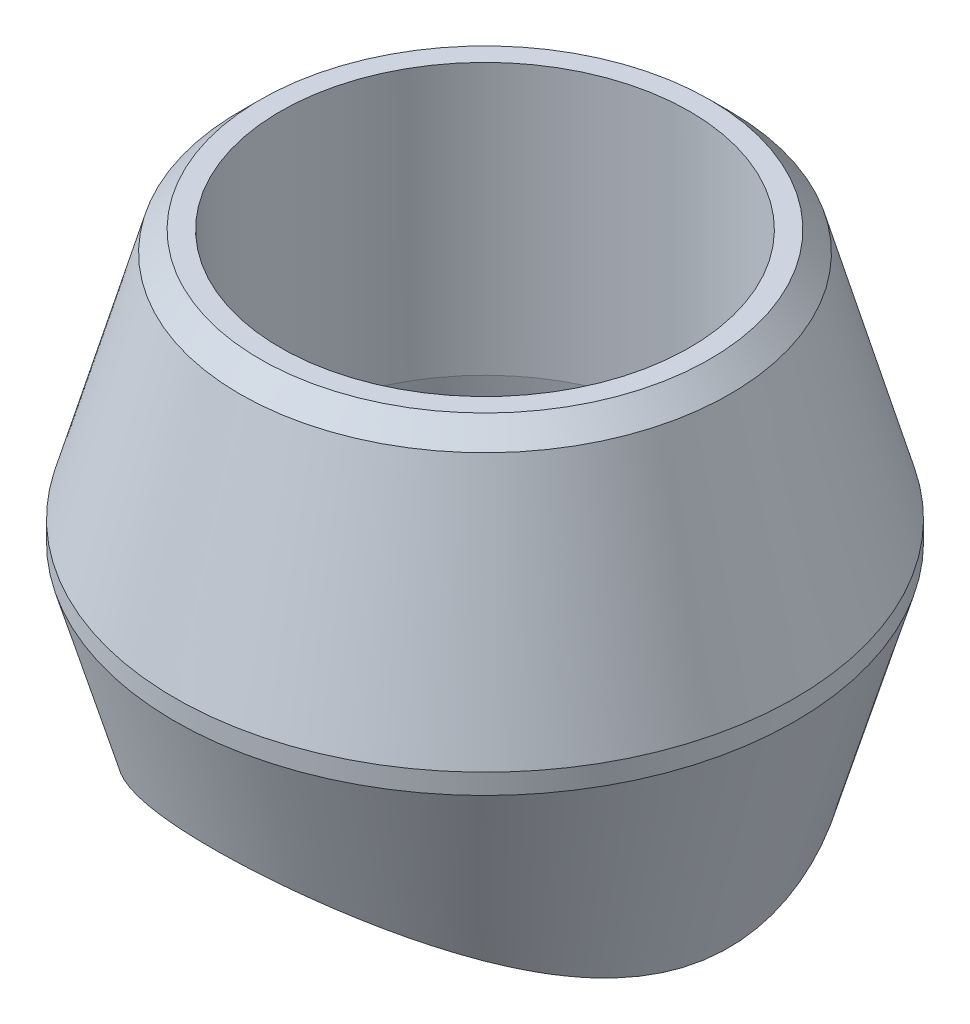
ISO-10303-21;
HEADER;
FILE_DESCRIPTION(('STEP AP214'),'2;1');
FILE_NAME('part.step','',(''),(''),'','','');
FILE_SCHEMA(('AUTOMOTIVE_DESIGN { 1 0 10303 214 1 1 1 1 }'));
ENDSEC;
DATA;
#1=APPLICATION_CONTEXT('core data for automotive mechanical design processes');
#2=APPLICATION_PROTOCOL_DEFINITION('international standard','automotive_design',2000,#1);
#3=PRODUCT_CONTEXT('',#1,'mechanical');
#4=PRODUCT('Part','Part','',(#3));
#5=PRODUCT_RELATED_PRODUCT_CATEGORY('part','',(#4));
#6=PRODUCT_DEFINITION_FORMATION('','',#4);
#7=PRODUCT_DEFINITION_CONTEXT('part definition',#1,'design');
#8=PRODUCT_DEFINITION('design','',#6,#7);
#9=PRODUCT_DEFINITION_SHAPE('','',#8);
#10=(LENGTH_UNIT() NAMED_UNIT(*) SI_UNIT(.MILLI.,.METRE.));
#11=(NAMED_UNIT(*) PLANE_ANGLE_UNIT() SI_UNIT($,.RADIAN.));
#12=(NAMED_UNIT(*) SI_UNIT($,.STERADIAN.) SOLID_ANGLE_UNIT());
#13=UNCERTAINTY_MEASURE_WITH_UNIT(LENGTH_MEASURE(1.E-05),#10,'distance_accuracy_value','');
#14=(GEOMETRIC_REPRESENTATION_CONTEXT(3) GLOBAL_UNCERTAINTY_ASSIGNED_CONTEXT((#13)) GLOBAL_UNIT_ASSIGNED_CONTEXT((#10,
#11,#12)) REPRESENTATION_CONTEXT('',''));
#15=CARTESIAN_POINT('',(0.,0.,0.));
#16=DIRECTION('',(0.,0.,1.));
#17=DIRECTION('',(1.,0.,0.));
#18=AXIS2_PLACEMENT_3D('',#15,#16,#17);
#19=CARTESIAN_POINT('',(0.,36.4813097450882,0.));
#20=DIRECTION('',(0.,1.,0.));
#21=DIRECTION('',(0.,0.,1.));
#22=AXIS2_PLACEMENT_3D('',#19,#20,#21);
#23=CONICAL_SURFACE('',#22,25.4,0.281926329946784);
#24=CARTESIAN_POINT('',(-14.6804491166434,21.8518971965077,-15.2428727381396));
#25=CARTESIAN_POINT('',(-13.8315857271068,22.3677564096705,-16.2671575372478));
#26=CARTESIAN_POINT('',(-12.8911716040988,22.8785568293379,-17.208947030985));
#27=CARTESIAN_POINT('',(-10.7947108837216,23.8452839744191,-18.9190722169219));
#28=CARTESIAN_POINT('',(-9.63355555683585,24.2998824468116,-19.6839459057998));
#29=CARTESIAN_POINT('',(-7.17115096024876,25.0652491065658,-20.9428980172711));
#30=CARTESIAN_POINT('',(-5.82080202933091,25.3876088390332,-21.4563056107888));
#31=CARTESIAN_POINT('',(-3.07181575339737,25.8244609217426,-22.1462679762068));
#32=CARTESIAN_POINT('',(-1.61462849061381,25.9473238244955,-22.3367139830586));
#33=CARTESIAN_POINT('',(2.71916875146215,25.9745039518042,-22.3792786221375));
#34=CARTESIAN_POINT('',(5.57503933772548,25.5294190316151,-21.7002590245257));
#35=CARTESIAN_POINT('',(9.33155335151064,24.4064651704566,-19.8617893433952));
#36=CARTESIAN_POINT('',(10.5071248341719,23.9621648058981,-19.1183814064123));
#37=CARTESIAN_POINT('',(12.6171117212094,23.0168227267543,-17.4591392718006));
#38=CARTESIAN_POINT('',(13.5768703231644,22.509913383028,-16.5349051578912));
#39=CARTESIAN_POINT('',(15.3242127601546,21.4704502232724,-14.4966572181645));
#40=CARTESIAN_POINT('',(16.1013412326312,20.9431577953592,-13.3912302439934));
#41=CARTESIAN_POINT('',(17.4393283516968,19.9546113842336,-11.0695112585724));
#42=CARTESIAN_POINT('',(18.0100190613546,19.4871494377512,-9.84358152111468));
#43=CARTESIAN_POINT('',(18.956651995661,18.6651330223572,-7.22626596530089));
#44=CARTESIAN_POINT('',(19.320311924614,18.3221720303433,-5.85994487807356));
#45=CARTESIAN_POINT('',(19.8167669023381,17.842561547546,-3.06500714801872));
#46=CARTESIAN_POINT('',(19.9510201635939,17.7058088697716,-1.59590452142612));
#47=CARTESIAN_POINT('',(19.966876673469,17.689835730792,1.29114854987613));
#48=CARTESIAN_POINT('',(19.8554181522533,17.8038483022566,2.72988471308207));
#49=CARTESIAN_POINT('',(19.3873450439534,18.2585551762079,5.5762934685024));
#50=CARTESIAN_POINT('',(19.0412114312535,18.5862504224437,6.93217327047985));
#51=CARTESIAN_POINT('',(17.6967865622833,19.7685882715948,10.8100988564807));
#52=CARTESIAN_POINT('',(16.3567439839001,20.8341954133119,13.2235702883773));
#53=CARTESIAN_POINT('',(12.980715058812,22.8838423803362,17.2904553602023));
#54=CARTESIAN_POINT('',(10.8436545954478,23.9239898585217,19.0670900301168));
#55=CARTESIAN_POINT('',(5.90228519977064,25.4593619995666,21.58971968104));
#56=CARTESIAN_POINT('',(3.05722371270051,25.9400866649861,22.3255554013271));
#57=CARTESIAN_POINT('',(-2.71575059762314,25.9726725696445,22.3762357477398));
#58=CARTESIAN_POINT('',(-5.59176000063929,25.5225121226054,21.6886134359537));
#59=CARTESIAN_POINT('',(-9.33050493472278,24.4077419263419,19.8640479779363));
#60=CARTESIAN_POINT('',(-10.4788699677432,23.9738430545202,19.1383861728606));
#61=CARTESIAN_POINT('',(-12.6219264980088,23.0156321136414,17.4575350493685));
#62=CARTESIAN_POINT('',(-13.5898587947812,22.502474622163,16.5205001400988));
#63=CARTESIAN_POINT('',(-16.1796292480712,20.9610009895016,13.4973309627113));
#64=CARTESIAN_POINT('',(-17.5462237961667,19.8911835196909,11.1212509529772));
#65=CARTESIAN_POINT('',(-18.9462608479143,18.6735077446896,7.25731995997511));
#66=CARTESIAN_POINT('',(-19.3157831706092,18.3265393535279,5.88462355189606));
#67=CARTESIAN_POINT('',(-19.8150058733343,17.8442672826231,3.07574916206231));
#68=CARTESIAN_POINT('',(-19.9480281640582,17.7087617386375,1.65183929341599));
#69=CARTESIAN_POINT('',(-19.9798143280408,17.676922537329,-2.70397483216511));
#70=CARTESIAN_POINT('',(-19.5040418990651,18.1788532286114,-5.5838484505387));
#71=CARTESIAN_POINT('',(-18.1499778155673,19.3702385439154,-9.50943315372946));
#72=CARTESIAN_POINT('',(-17.5985028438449,19.8279102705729,-10.7448419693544));
#73=CARTESIAN_POINT('',(-16.2934501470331,20.8082329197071,-13.0953381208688));
#74=CARTESIAN_POINT('',(-15.52931250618,21.3360379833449,-14.2185879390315));
#75=CARTESIAN_POINT('',(-14.6804491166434,21.8518971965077,-15.2428727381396));
#76=B_SPLINE_CURVE_WITH_KNOTS('',3,(#24,#25,#26,#27,#28,#29,#30,#31,#32,#33,#34,#35,#36,#37,#38,
#39,#40,#41,#42,#43,#44,#45,#46,#47,#48,#49,#50,#51,#52,#53,#54,#55,#56,#57,#58,#59,#60,#61,#62,
#63,#64,#65,#66,#67,#68,#69,#70,#71,#72,#73,#74,#75),.UNSPECIFIED.,.T.,.F.,(4,2,2,2,2,2,2,2,2,2,
2,2,2,2,2,2,2,2,2,2,2,2,2,2,2,4),(-0.126803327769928,-0.122676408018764,-0.118549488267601,
-0.114422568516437,-0.110295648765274,-0.102041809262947,-0.0979148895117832,
-0.0937879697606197,-0.0896610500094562,-0.0855341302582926,-0.0814072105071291,
-0.0772802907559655,-0.073153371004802,-0.0690264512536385,-0.0607726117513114,
-0.0525187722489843,-0.0442649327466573,-0.0360110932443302,-0.0318841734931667,
-0.0277572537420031,-0.0195034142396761,-0.0153764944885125,-0.011249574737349,
-0.00299573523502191,0.00113118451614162,0.00525810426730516),.UNSPECIFIED.);
#77=CARTESIAN_POINT('',(-14.6804491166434,21.8518971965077,-15.2428727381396));
#78=VERTEX_POINT('',#77);
#79=EDGE_CURVE('E139',#78,#78,#76,.F.);
#80=ORIENTED_EDGE('',*,*,#79,.T.);
#81=EDGE_LOOP('',(#80));
#82=FACE_BOUND('',#81,.T.);
#83=CARTESIAN_POINT('',(0.,36.4813097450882,0.));
#84=DIRECTION('',(0.,-1.,0.));
#85=DIRECTION('',(0.,0.,-1.));
#86=AXIS2_PLACEMENT_3D('',#83,#84,#85);
#87=CIRCLE('',#86,25.4);
#88=CARTESIAN_POINT('',(0.,36.4813097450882,-25.4));
#89=VERTEX_POINT('',#88);
#90=EDGE_CURVE('E275',#89,#89,#87,.T.);
#91=ORIENTED_EDGE('',*,*,#90,.T.);
#92=EDGE_LOOP('',(#91));
#93=FACE_BOUND('',#92,.T.);
#94=ADVANCED_FACE('F166',(#82,#93),#23,.T.);
#95=CARTESIAN_POINT('',(0.,0.,0.));
#96=DIRECTION('',(0.,-1.,0.));
#97=DIRECTION('',(0.,0.,-1.));
#98=AXIS2_PLACEMENT_3D('',#95,#96,#97);
#99=CYLINDRICAL_SURFACE('',#98,16.764);
#100=CARTESIAN_POINT('',(0.,36.4813097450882,0.));
#101=DIRECTION('',(0.,1.,0.));
#102=DIRECTION('',(0.,0.,1.));
#103=AXIS2_PLACEMENT_3D('',#100,#101,#102);
#104=CIRCLE('',#103,16.764);
#105=CARTESIAN_POINT('',(0.,36.4813097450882,16.764));
#106=VERTEX_POINT('',#105);
#107=EDGE_CURVE('E278',#106,#106,#104,.F.);
#108=ORIENTED_EDGE('',*,*,#107,.T.);
#109=EDGE_LOOP('',(#108));
#110=FACE_BOUND('',#109,.T.);
#111=CARTESIAN_POINT('',(0.,58.674,0.));
#112=DIRECTION('',(0.,-1.,0.));
#113=DIRECTION('',(0.,0.,-1.));
#114=AXIS2_PLACEMENT_3D('',#111,#112,#113);
#115=CIRCLE('',#114,16.764);
#116=CARTESIAN_POINT('',(0.,58.674,-16.764));
#117=VERTEX_POINT('',#116);
#118=EDGE_CURVE('E189',#117,#117,#115,.T.);
#119=ORIENTED_EDGE('',*,*,#118,.F.);
#120=EDGE_LOOP('',(#119));
#121=FACE_BOUND('',#120,.T.);
#122=ADVANCED_FACE('F266',(#110,#121),#99,.F.);
#123=CARTESIAN_POINT('',(-7.05507719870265,58.674,0.));
#124=DIRECTION('',(0.,-1.,0.));
#125=DIRECTION('',(0.,0.,-1.));
#126=AXIS2_PLACEMENT_3D('',#123,#124,#125);
#127=PLANE('',#126);
#128=CARTESIAN_POINT('',(0.,58.674,0.));
#129=DIRECTION('',(0.,-1.,0.));
#130=DIRECTION('',(0.,0.,-1.));
#131=AXIS2_PLACEMENT_3D('',#128,#129,#130);
#132=CIRCLE('',#131,18.415);
#133=CARTESIAN_POINT('',(0.,58.674,-18.415));
#134=VERTEX_POINT('',#133);
#135=EDGE_CURVE('E197',#134,#134,#132,.T.);
#136=ORIENTED_EDGE('',*,*,#135,.F.);
#137=EDGE_LOOP('',(#136));
#138=FACE_BOUND('',#137,.T.);
#139=ORIENTED_EDGE('',*,*,#118,.T.);
#140=EDGE_LOOP('',(#139));
#141=FACE_BOUND('',#140,.T.);
#142=ADVANCED_FACE('F270',(#138,#141),#127,.F.);
#143=CARTESIAN_POINT('',(0.,58.674,0.));
#144=DIRECTION('',(0.,-1.,0.));
#145=DIRECTION('',(0.,0.,-1.));
#146=AXIS2_PLACEMENT_3D('',#143,#144,#145);
#147=CONICAL_SURFACE('',#146,18.415,0.785398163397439);
#148=CARTESIAN_POINT('',(0.,57.023,0.));
#149=DIRECTION('',(0.,-1.,0.));
#150=DIRECTION('',(0.,0.,-1.));
#151=AXIS2_PLACEMENT_3D('',#148,#149,#150);
#152=CIRCLE('',#151,20.066);
#153=CARTESIAN_POINT('',(0.,57.023,-20.066));
#154=VERTEX_POINT('',#153);
#155=EDGE_CURVE('E202',#154,#154,#152,.T.);
#156=ORIENTED_EDGE('',*,*,#155,.F.);
#157=EDGE_LOOP('',(#156));
#158=FACE_BOUND('',#157,.T.);
#159=ORIENTED_EDGE('',*,*,#135,.T.);
#160=EDGE_LOOP('',(#159));
#161=FACE_BOUND('',#160,.T.);
#162=ADVANCED_FACE('F290',(#158,#161),#147,.T.);
#163=CARTESIAN_POINT('',(0.,57.023,0.));
#164=DIRECTION('',(0.,-1.,0.));
#165=DIRECTION('',(0.,0.,-1.));
#166=AXIS2_PLACEMENT_3D('',#163,#164,#165);
#167=CONICAL_SURFACE('',#166,20.066,0.275196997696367);
#168=CARTESIAN_POINT('',(0.,38.1323097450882,0.));
#169=DIRECTION('',(0.,-1.,0.));
#170=DIRECTION('',(0.,0.,-1.));
#171=AXIS2_PLACEMENT_3D('',#168,#169,#170);
#172=CIRCLE('',#171,25.4);
#173=CARTESIAN_POINT('',(0.,38.1323097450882,-25.4));
#174=VERTEX_POINT('',#173);
#175=EDGE_CURVE('E277',#174,#174,#172,.T.);
#176=ORIENTED_EDGE('',*,*,#175,.F.);
#177=EDGE_LOOP('',(#176));
#178=FACE_BOUND('',#177,.T.);
#179=ORIENTED_EDGE('',*,*,#155,.T.);
#180=EDGE_LOOP('',(#179));
#181=FACE_BOUND('',#180,.T.);
#182=ADVANCED_FACE('F288',(#178,#181),#167,.T.);
#183=CARTESIAN_POINT('',(0.,0.,0.));
#184=DIRECTION('',(0.,-1.,0.));
#185=DIRECTION('',(0.,0.,-1.));
#186=AXIS2_PLACEMENT_3D('',#183,#184,#185);
#187=CYLINDRICAL_SURFACE('',#186,25.4);
#188=ORIENTED_EDGE('',*,*,#90,.F.);
#189=EDGE_LOOP('',(#188));
#190=FACE_BOUND('',#189,.T.);
#191=ORIENTED_EDGE('',*,*,#175,.T.);
#192=EDGE_LOOP('',(#191));
#193=FACE_BOUND('',#192,.T.);
#194=ADVANCED_FACE('F225',(#190,#193),#187,.T.);
#195=CARTESIAN_POINT('',(0.,0.,25.4));
#196=DIRECTION('',(0.,0.,-1.));
#197=DIRECTION('',(-1.,0.,0.));
#198=AXIS2_PLACEMENT_3D('',#195,#196,#197);
#199=CYLINDRICAL_SURFACE('',#198,25.4);
#200=CARTESIAN_POINT('',(-13.6486273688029,21.4213671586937,-14.6216164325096));
#201=CARTESIAN_POINT('',(-13.8913343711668,21.2667437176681,-14.3163394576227));
#202=CARTESIAN_POINT('',(-14.125097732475,21.111976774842,-14.00406722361));
#203=CARTESIAN_POINT('',(-14.5762222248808,20.8030366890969,-13.3644192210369));
#204=CARTESIAN_POINT('',(-14.7934789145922,20.6488723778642,-13.0369654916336));
#205=CARTESIAN_POINT('',(-15.2101388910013,20.3439415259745,-12.3695863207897));
#206=CARTESIAN_POINT('',(-15.409549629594,20.1931735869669,-12.0296661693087));
#207=CARTESIAN_POINT('',(-15.7894911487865,19.8975138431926,-11.3391979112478));
#208=CARTESIAN_POINT('',(-15.970101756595,19.7525989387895,-10.9887036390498));
#209=CARTESIAN_POINT('',(-16.3136304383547,19.4699230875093,-10.2765865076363));
#210=CARTESIAN_POINT('',(-16.4765573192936,19.3321585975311,-9.91496930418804));
#211=CARTESIAN_POINT('',(-16.7847079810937,19.065393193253,-9.17970955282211));
#212=CARTESIAN_POINT('',(-16.9298795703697,18.9364185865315,-8.80603544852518));
#213=CARTESIAN_POINT('',(-17.1341688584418,18.7508862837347,-8.23714031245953));
#214=CARTESIAN_POINT('',(-17.200150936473,18.6902390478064,-8.04568036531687));
#215=CARTESIAN_POINT('',(-17.327595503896,18.5720033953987,-7.65972146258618));
#216=CARTESIAN_POINT('',(-17.3890458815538,18.5144232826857,-7.46521593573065));
#217=CARTESIAN_POINT('',(-17.5072170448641,18.4028725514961,-7.0734791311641));
#218=CARTESIAN_POINT('',(-17.5639321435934,18.3489062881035,-6.8762448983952));
#219=CARTESIAN_POINT('',(-17.6725966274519,18.2447141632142,-6.47927931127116));
#220=CARTESIAN_POINT('',(-17.7245415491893,18.1944918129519,-6.27954581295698));
#221=CARTESIAN_POINT('',(-17.82360474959,18.0980116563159,-5.87777740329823));
#222=CARTESIAN_POINT('',(-17.8707196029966,18.051756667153,-5.67574097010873));
#223=CARTESIAN_POINT('',(-17.9600685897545,17.9634102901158,-5.26957142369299));
#224=CARTESIAN_POINT('',(-18.0023001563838,17.9213210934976,-5.0654372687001));
#225=CARTESIAN_POINT('',(-18.0818268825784,17.841511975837,-4.65527477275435));
#226=CARTESIAN_POINT('',(-18.1191201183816,17.8037937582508,-4.44924572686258));
#227=CARTESIAN_POINT('',(-18.188715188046,17.732930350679,-4.03549671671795));
#228=CARTESIAN_POINT('',(-18.2210154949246,17.6997865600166,-3.82777625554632));
#229=CARTESIAN_POINT('',(-18.2805698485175,17.6382759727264,-3.41084763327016));
#230=CARTESIAN_POINT('',(-18.3078224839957,17.609910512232,-3.20163907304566));
#231=CARTESIAN_POINT('',(-18.3572268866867,17.5581604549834,-2.78193761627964));
#232=CARTESIAN_POINT('',(-18.3793770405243,17.5347774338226,-2.57144433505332));
#233=CARTESIAN_POINT('',(-18.418522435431,17.4931947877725,-2.14937687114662));
#234=CARTESIAN_POINT('',(-18.4355155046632,17.4749973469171,-1.93780227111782));
#235=CARTESIAN_POINT('',(-18.4642921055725,17.4439919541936,-1.51377560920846));
#236=CARTESIAN_POINT('',(-18.4760725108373,17.4311872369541,-1.30132309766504));
#237=CARTESIAN_POINT('',(-18.4943730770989,17.4111581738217,-0.875744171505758));
#238=CARTESIAN_POINT('',(-18.5008887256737,17.4039386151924,-0.6626173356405));
#239=CARTESIAN_POINT('',(-18.5085963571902,17.3953253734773,-0.235892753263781));
#240=CARTESIAN_POINT('',(-18.5097819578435,17.3939386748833,-0.0222947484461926));
#241=CARTESIAN_POINT('',(-18.5068207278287,17.3970246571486,0.404444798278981));
#242=CARTESIAN_POINT('',(-18.5026832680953,17.4014870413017,0.617586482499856));
#243=CARTESIAN_POINT('',(-18.4891251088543,17.4159998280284,1.04267086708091));
#244=CARTESIAN_POINT('',(-18.4797252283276,17.4260282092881,1.25461498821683));
#245=CARTESIAN_POINT('',(-18.4556768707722,17.4515710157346,1.67736771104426));
#246=CARTESIAN_POINT('',(-18.4410408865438,17.4670723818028,1.8881778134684));
#247=CARTESIAN_POINT('',(-18.4065671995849,17.5034046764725,2.3087273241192));
#248=CARTESIAN_POINT('',(-18.3867339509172,17.5242310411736,2.51846749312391));
#249=CARTESIAN_POINT('',(-18.3419111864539,17.5710719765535,2.93694326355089));
#250=CARTESIAN_POINT('',(-18.3169185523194,17.5970896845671,3.14567817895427));
#251=CARTESIAN_POINT('',(-18.2618137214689,17.6541698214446,3.56220786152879));
#252=CARTESIAN_POINT('',(-18.231691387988,17.6852422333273,3.76999991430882));
#253=CARTESIAN_POINT('',(-18.1664086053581,17.7522749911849,4.18464627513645));
#254=CARTESIAN_POINT('',(-18.1312334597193,17.7882495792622,4.39149596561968));
#255=CARTESIAN_POINT('',(-18.055723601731,17.864903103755,4.80366746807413));
#256=CARTESIAN_POINT('',(-18.0153820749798,17.9055882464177,5.00898687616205));
#257=CARTESIAN_POINT('',(-17.9297164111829,17.9913093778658,5.41768251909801));
#258=CARTESIAN_POINT('',(-17.884391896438,18.0363456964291,5.62105860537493));
#259=CARTESIAN_POINT('',(-17.788895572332,18.1304469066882,6.02549713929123));
#260=CARTESIAN_POINT('',(-17.7387287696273,18.1795076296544,6.22656174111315));
#261=CARTESIAN_POINT('',(-17.6336890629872,18.2813340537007,6.62600837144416));
#262=CARTESIAN_POINT('',(-17.5788267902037,18.3340913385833,6.82439534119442));
#263=CARTESIAN_POINT('',(-17.4645468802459,18.4429675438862,7.21811667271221));
#264=CARTESIAN_POINT('',(-17.4051456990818,18.4990741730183,7.41345923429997));
#265=CARTESIAN_POINT('',(-17.2205552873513,18.6717694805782,7.99344730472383));
#266=CARTESIAN_POINT('',(-17.0883587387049,18.7933392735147,8.3744143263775));
#267=CARTESIAN_POINT('',(-16.8054370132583,19.0469581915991,9.12621657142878));
#268=CARTESIAN_POINT('',(-16.6546948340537,19.1790168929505,9.49704211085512));
#269=CARTESIAN_POINT('',(-16.3349586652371,19.4517814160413,10.2281981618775));
#270=CARTESIAN_POINT('',(-16.1659381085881,19.5924996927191,10.5885124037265));
#271=CARTESIAN_POINT('',(-15.8100650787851,19.8804635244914,11.2974849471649));
#272=CARTESIAN_POINT('',(-15.6232141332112,20.0277085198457,11.6461442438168));
#273=CARTESIAN_POINT('',(-15.2321062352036,20.326624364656,12.3306532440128));
#274=CARTESIAN_POINT('',(-15.0278810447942,20.4782868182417,12.6665247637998));
#275=CARTESIAN_POINT('',(-14.6024581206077,20.7839278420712,13.3243044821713));
#276=CARTESIAN_POINT('',(-14.38132333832,20.9378962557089,13.6462580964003));
#277=CARTESIAN_POINT('',(-13.9224645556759,21.2460218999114,14.2750191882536));
#278=CARTESIAN_POINT('',(-13.6848347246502,21.4001738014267,14.5818979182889));
#279=CARTESIAN_POINT('',(-13.19215335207,21.7074532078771,15.1811269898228));
#280=CARTESIAN_POINT('',(-12.9371241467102,21.8605817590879,15.4734951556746));
#281=CARTESIAN_POINT('',(-12.4085767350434,22.1648686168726,16.044166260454));
#282=CARTESIAN_POINT('',(-12.1350022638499,22.3160191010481,16.3224214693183));
#283=CARTESIAN_POINT('',(-11.7110592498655,22.5396882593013,16.7278278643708));
#284=CARTESIAN_POINT('',(-11.5673330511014,22.6138067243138,16.8610926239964));
#285=CARTESIAN_POINT('',(-11.2752588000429,22.7608396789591,17.1235321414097));
#286=CARTESIAN_POINT('',(-11.1269058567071,22.8337527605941,17.2527022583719));
#287=CARTESIAN_POINT('',(-10.8257197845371,22.9780716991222,17.506647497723));
#288=CARTESIAN_POINT('',(-10.6728858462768,23.0494772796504,17.6314218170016));
#289=CARTESIAN_POINT('',(-10.3635536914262,23.1902143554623,17.8758564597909));
#290=CARTESIAN_POINT('',(-10.2070758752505,23.2595539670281,17.9955379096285));
#291=CARTESIAN_POINT('',(-9.89044128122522,23.3959691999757,18.2296290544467));
#292=CARTESIAN_POINT('',(-9.73030350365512,23.4630533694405,18.3440594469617));
#293=CARTESIAN_POINT('',(-9.40621533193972,23.5948375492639,18.5676337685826));
#294=CARTESIAN_POINT('',(-9.24227794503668,23.6595441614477,18.6767926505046));
#295=CARTESIAN_POINT('',(-8.91045780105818,23.7864590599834,18.8898115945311));
#296=CARTESIAN_POINT('',(-8.7425817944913,23.8486711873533,18.9936798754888));
#297=CARTESIAN_POINT('',(-8.40273302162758,23.9704629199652,19.1960816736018));
#298=CARTESIAN_POINT('',(-8.23076065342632,24.0300427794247,19.2946157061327));
#299=CARTESIAN_POINT('',(-7.88264279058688,24.1465147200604,19.4864108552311));
#300=CARTESIAN_POINT('',(-7.70649147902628,24.2034026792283,19.5796639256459));
#301=CARTESIAN_POINT('',(-7.34993556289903,24.314058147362,19.7604556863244));
#302=CARTESIAN_POINT('',(-7.16952471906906,24.3678206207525,19.8479851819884));
#303=CARTESIAN_POINT('',(-6.80470149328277,24.4717845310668,20.0167839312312));
#304=CARTESIAN_POINT('',(-6.62028764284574,24.5219846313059,20.098050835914));
#305=CARTESIAN_POINT('',(-6.24783391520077,24.6187322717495,20.2542361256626));
#306=CARTESIAN_POINT('',(-6.05979379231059,24.6652795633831,20.3291540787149));
#307=CARTESIAN_POINT('',(-5.68039048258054,24.7545507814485,20.4724542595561));
#308=CARTESIAN_POINT('',(-5.48902798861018,24.7972754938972,20.540837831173));
#309=CARTESIAN_POINT('',(-5.10330267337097,24.8787520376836,20.6709086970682));
#310=CARTESIAN_POINT('',(-4.90894120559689,24.9175056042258,20.7325989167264));
#311=CARTESIAN_POINT('',(-4.51753571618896,24.9908847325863,20.8491156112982));
#312=CARTESIAN_POINT('',(-4.32049343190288,25.0255128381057,20.9039463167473));
#313=CARTESIAN_POINT('',(-3.92404574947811,25.0904875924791,21.0065787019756));
#314=CARTESIAN_POINT('',(-3.72464220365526,25.1208373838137,21.0543855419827));
#315=CARTESIAN_POINT('',(-3.3237913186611,25.1771018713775,21.142804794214));
#316=CARTESIAN_POINT('',(-3.12234570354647,25.203020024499,21.1834228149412));
#317=CARTESIAN_POINT('',(-2.71773032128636,25.2502679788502,21.2572996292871));
#318=CARTESIAN_POINT('',(-2.51456194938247,25.2716011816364,21.2905638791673));
#319=CARTESIAN_POINT('',(-2.10682087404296,25.3095264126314,21.3495690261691));
#320=CARTESIAN_POINT('',(-1.9022491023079,25.3261213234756,21.3753144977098));
#321=CARTESIAN_POINT('',(-1.49202107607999,25.3544173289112,21.4191183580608));
#322=CARTESIAN_POINT('',(-1.28636524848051,25.366120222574,21.4371795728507));
#323=CARTESIAN_POINT('',(-0.874289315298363,25.3844812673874,21.4654534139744));
#324=CARTESIAN_POINT('',(-0.66786921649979,25.3911394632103,21.4756661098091));
#325=CARTESIAN_POINT('',(-0.254583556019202,25.3992566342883,21.4880774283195));
#326=CARTESIAN_POINT('',(-0.0477178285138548,25.4007131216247,21.4902722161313));
#327=CARTESIAN_POINT('',(0.365846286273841,25.3982907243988,21.4865047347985));
#328=CARTESIAN_POINT('',(0.572544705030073,25.3944134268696,21.4805448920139));
#329=CARTESIAN_POINT('',(0.985185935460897,25.3814835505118,21.4606343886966));
#330=CARTESIAN_POINT('',(1.19112929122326,25.3724360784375,21.4466916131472));
#331=CARTESIAN_POINT('',(1.60197578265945,25.3493230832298,21.4109826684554));
#332=CARTESIAN_POINT('',(1.80687926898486,25.3352593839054,21.3892193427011));
#333=CARTESIAN_POINT('',(2.21536080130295,25.3022744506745,21.3380403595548));
#334=CARTESIAN_POINT('',(2.41893866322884,25.2833525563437,21.3086236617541));
#335=CARTESIAN_POINT('',(2.82448430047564,25.2408098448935,21.2423065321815));
#336=CARTESIAN_POINT('',(3.02645118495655,25.2171865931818,21.205402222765));
#337=CARTESIAN_POINT('',(3.42849026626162,25.1653993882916,21.1242777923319));
#338=CARTESIAN_POINT('',(3.62856082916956,25.1372318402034,21.0800518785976));
#339=CARTESIAN_POINT('',(4.02652266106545,25.0765135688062,20.9844511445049));
#340=CARTESIAN_POINT('',(4.22441162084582,25.0439586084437,20.9330694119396));
#341=CARTESIAN_POINT('',(4.61772558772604,24.974622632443,20.823323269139));
#342=CARTESIAN_POINT('',(4.81314775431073,24.9378371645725,20.764951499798));
#343=CARTESIAN_POINT('',(5.20124307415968,24.8601966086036,20.6413905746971));
#344=CARTESIAN_POINT('',(5.3939130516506,24.819337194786,20.5761941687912));
#345=CARTESIAN_POINT('',(5.77621955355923,24.733705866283,20.4391497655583));
#346=CARTESIAN_POINT('',(5.96585279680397,24.6889300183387,20.367295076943));
#347=CARTESIAN_POINT('',(6.34179797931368,24.5956189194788,20.217095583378));
#348=CARTESIAN_POINT('',(6.52810677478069,24.5470803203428,20.1387449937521));
#349=CARTESIAN_POINT('',(6.89712675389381,24.4464107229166,19.9757293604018));
#350=CARTESIAN_POINT('',(7.07983519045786,24.3942771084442,19.891059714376));
#351=CARTESIAN_POINT('',(7.44133376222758,24.2865317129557,19.7155271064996));
#352=CARTESIAN_POINT('',(7.62012176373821,24.2309180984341,19.6246608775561));
#353=CARTESIAN_POINT('',(7.97375269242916,24.1164816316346,19.4369901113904));
#354=CARTESIAN_POINT('',(8.14859137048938,24.0576555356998,19.340179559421));
#355=CARTESIAN_POINT('',(8.49447376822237,23.9371705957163,19.1409588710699));
#356=CARTESIAN_POINT('',(8.66551061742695,23.8755071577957,19.0385395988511));
#357=CARTESIAN_POINT('',(9.00365754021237,23.7495598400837,18.8282896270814));
#358=CARTESIAN_POINT('',(9.17076082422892,23.6852718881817,18.720450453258));
#359=CARTESIAN_POINT('',(9.50095417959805,23.5543397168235,18.4996016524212));
#360=CARTESIAN_POINT('',(9.66403809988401,23.4876922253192,18.3865847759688));
#361=CARTESIAN_POINT('',(9.98609295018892,23.3522912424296,18.1556071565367));
#362=CARTESIAN_POINT('',(10.1450587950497,23.2835353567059,18.0376407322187));
#363=CARTESIAN_POINT('',(10.4587826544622,23.1441705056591,17.7969925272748));
#364=CARTESIAN_POINT('',(10.6135370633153,23.0735600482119,17.6743069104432));
#365=CARTESIAN_POINT('',(10.9187340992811,22.9307418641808,17.4244535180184));
#366=CARTESIAN_POINT('',(11.0691749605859,22.8585335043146,17.2972839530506));
#367=CARTESIAN_POINT('',(11.5137825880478,22.6399412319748,16.9094861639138));
#368=CARTESIAN_POINT('',(11.8013990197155,22.491516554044,16.642442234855));
#369=CARTESIAN_POINT('',(12.3581917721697,22.1913316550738,16.0931804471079));
#370=CARTESIAN_POINT('',(12.6274130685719,22.0395808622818,15.8110028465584));
#371=CARTESIAN_POINT('',(13.1466286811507,21.7347109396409,15.2332655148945));
#372=CARTESIAN_POINT('',(13.3967167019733,21.5816032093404,14.9377840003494));
#373=CARTESIAN_POINT('',(13.8790874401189,21.2747909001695,14.3324112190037));
#374=CARTESIAN_POINT('',(14.1113530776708,21.1210858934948,14.0225065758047));
#375=CARTESIAN_POINT('',(14.5599453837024,20.8140793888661,13.3871956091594));
#376=CARTESIAN_POINT('',(14.7761408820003,20.6607893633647,13.0616912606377));
#377=CARTESIAN_POINT('',(15.1919354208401,20.3568043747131,12.3966182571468));
#378=CARTESIAN_POINT('',(15.3914512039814,20.2061250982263,12.0569904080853));
#379=CARTESIAN_POINT('',(15.7732369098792,19.9096166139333,11.365096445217));
#380=CARTESIAN_POINT('',(15.9554710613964,19.7637978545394,11.0128061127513));
#381=CARTESIAN_POINT('',(16.3020370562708,19.4792557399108,10.2970167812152));
#382=CARTESIAN_POINT('',(16.4663793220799,19.340528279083,9.93352446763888));
#383=CARTESIAN_POINT('',(16.7765252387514,19.0724478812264,9.19677771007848));
#384=CARTESIAN_POINT('',(16.9223834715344,18.9430678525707,8.82355612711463));
#385=CARTESIAN_POINT('',(17.1950303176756,18.6957345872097,8.06826649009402));
#386=CARTESIAN_POINT('',(17.321891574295,18.5777384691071,7.68623893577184));
#387=CARTESIAN_POINT('',(17.4983507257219,18.41094156,7.10565354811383));
#388=CARTESIAN_POINT('',(17.55491733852,18.3569906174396,6.91065802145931));
#389=CARTESIAN_POINT('',(17.663473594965,18.2525972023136,6.51779793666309));
#390=CARTESIAN_POINT('',(17.7154492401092,18.2021655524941,6.31992661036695));
#391=CARTESIAN_POINT('',(17.8147639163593,18.1050577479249,5.92129060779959));
#392=CARTESIAN_POINT('',(17.862085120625,18.0583961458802,5.72051794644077));
#393=CARTESIAN_POINT('',(17.9520330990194,17.9690596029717,5.31604819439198));
#394=CARTESIAN_POINT('',(17.9946377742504,17.9264035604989,5.11234200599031));
#395=CARTESIAN_POINT('',(18.0750896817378,17.8453198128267,4.70197442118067));
#396=CARTESIAN_POINT('',(18.1129100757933,17.8069160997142,4.49530302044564));
#397=CARTESIAN_POINT('',(18.1837012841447,17.7346002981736,4.07927799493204));
#398=CARTESIAN_POINT('',(18.2166475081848,17.7007110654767,3.86991619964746));
#399=CARTESIAN_POINT('',(18.2772621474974,17.6381487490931,3.45025754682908));
#400=CARTESIAN_POINT('',(18.3049449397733,17.609461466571,3.23996489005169));
#401=CARTESIAN_POINT('',(18.3550031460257,17.5573931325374,2.81881596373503));
#402=CARTESIAN_POINT('',(18.3773959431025,17.5339947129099,2.60796390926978));
#403=CARTESIAN_POINT('',(18.416901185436,17.4925690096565,2.18576492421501));
#404=CARTESIAN_POINT('',(18.4340264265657,17.4745287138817,1.97442046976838));
#405=CARTESIAN_POINT('',(18.4630283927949,17.4438703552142,1.55130705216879));
#406=CARTESIAN_POINT('',(18.474913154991,17.4312439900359,1.33953924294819));
#407=CARTESIAN_POINT('',(18.4934493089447,17.4114839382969,0.915648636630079));
#408=CARTESIAN_POINT('',(18.5001038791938,17.4043469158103,0.703526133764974));
#409=CARTESIAN_POINT('',(18.5082575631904,17.3955705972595,0.278994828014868));
#410=CARTESIAN_POINT('',(18.5097549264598,17.393933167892,0.0665859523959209));
#411=CARTESIAN_POINT('',(18.5074361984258,17.3964040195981,-0.358824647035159));
#412=CARTESIAN_POINT('',(18.503603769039,17.40052996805,-0.571826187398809));
#413=CARTESIAN_POINT('',(18.4905375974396,17.4145182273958,-0.998316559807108));
#414=CARTESIAN_POINT('',(18.4812825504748,17.4244031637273,-1.21180398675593));
#415=CARTESIAN_POINT('',(18.4574899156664,17.4496885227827,-1.63859815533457));
#416=CARTESIAN_POINT('',(18.4429414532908,17.4651002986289,-1.85190361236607));
#417=CARTESIAN_POINT('',(18.4086189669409,17.5012812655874,-2.27766267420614));
#418=CARTESIAN_POINT('',(18.3888443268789,17.522051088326,-2.4901161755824));
#419=CARTESIAN_POINT('',(18.3441393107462,17.5687780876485,-2.91349774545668));
#420=CARTESIAN_POINT('',(18.3192186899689,17.5947254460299,-3.12442792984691));
#421=CARTESIAN_POINT('',(18.2643017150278,17.6516205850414,-3.5440955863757));
#422=CARTESIAN_POINT('',(18.234325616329,17.682548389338,-3.75283841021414));
#423=CARTESIAN_POINT('',(18.1692875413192,17.7493320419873,-4.16766349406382));
#424=CARTESIAN_POINT('',(18.1342511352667,17.7851630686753,-4.37375377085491));
#425=CARTESIAN_POINT('',(18.0592219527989,17.861391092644,-4.78426591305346));
#426=CARTESIAN_POINT('',(18.0192271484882,17.90178995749,-4.98868705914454));
#427=CARTESIAN_POINT('',(17.934274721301,17.9869438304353,-5.39589031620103));
#428=CARTESIAN_POINT('',(17.8893102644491,18.0317048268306,-5.59866974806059));
#429=CARTESIAN_POINT('',(17.7944546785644,18.1253329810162,-6.00240742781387));
#430=CARTESIAN_POINT('',(17.744557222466,18.1742053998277,-6.20336296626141));
#431=CARTESIAN_POINT('',(17.6398660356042,18.2758121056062,-6.60327200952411));
#432=CARTESIAN_POINT('',(17.5850667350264,18.3285507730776,-6.80222294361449));
#433=CARTESIAN_POINT('',(17.4706088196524,18.4376350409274,-7.19793614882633));
#434=CARTESIAN_POINT('',(17.410945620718,18.4939840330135,-7.39469615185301));
#435=CARTESIAN_POINT('',(17.224835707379,18.6679789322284,-7.98098355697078));
#436=CARTESIAN_POINT('',(17.0912011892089,18.7906387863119,-8.36677625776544));
#437=CARTESIAN_POINT('',(16.8064934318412,19.0457200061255,-9.12463418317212));
#438=CARTESIAN_POINT('',(16.6555690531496,19.1780549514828,-9.49678484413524));
#439=CARTESIAN_POINT('',(16.3363132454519,19.4506793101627,-10.2276464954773));
#440=CARTESIAN_POINT('',(16.168089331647,19.5909174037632,-10.5864236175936));
#441=CARTESIAN_POINT('',(15.8143473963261,19.8775643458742,-11.2917241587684));
#442=CARTESIAN_POINT('',(15.6288666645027,20.0239595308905,-11.6382718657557));
#443=CARTESIAN_POINT('',(15.2395251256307,20.3218457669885,-12.3204418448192));
#444=CARTESIAN_POINT('',(15.035602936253,20.4733526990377,-12.6560221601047));
#445=CARTESIAN_POINT('',(14.6094777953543,20.7795583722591,-13.3152084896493));
#446=CARTESIAN_POINT('',(14.387231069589,20.9342640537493,-13.6387829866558));
#447=CARTESIAN_POINT('',(13.9249600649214,21.244584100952,-14.2721546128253));
#448=CARTESIAN_POINT('',(13.6849476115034,21.4001977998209,-14.5819606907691));
#449=CARTESIAN_POINT('',(13.1883975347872,21.7097004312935,-15.1854934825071));
#450=CARTESIAN_POINT('',(12.9319627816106,21.863594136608,-15.4793023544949));
#451=CARTESIAN_POINT('',(12.4031001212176,22.1678173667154,-16.0497273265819));
#452=CARTESIAN_POINT('',(12.1307979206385,22.3181643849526,-16.3264501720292));
#453=CARTESIAN_POINT('',(11.7096491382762,22.5402773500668,-16.7289398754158));
#454=CARTESIAN_POINT('',(11.56740301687,22.6136251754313,-16.8607903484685));
#455=CARTESIAN_POINT('',(11.2787448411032,22.7589752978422,-17.1201964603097));
#456=CARTESIAN_POINT('',(11.1323383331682,22.8309791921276,-17.2477573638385));
#457=CARTESIAN_POINT('',(10.8352331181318,22.9735426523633,-17.4986882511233));
#458=CARTESIAN_POINT('',(10.684533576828,23.0441019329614,-17.6220574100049));
#459=CARTESIAN_POINT('',(10.378017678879,23.1837142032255,-17.8646336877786));
#460=CARTESIAN_POINT('',(10.2221831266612,23.2527599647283,-17.9838220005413));
#461=CARTESIAN_POINT('',(9.9056268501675,23.389121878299,-18.2178483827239));
#462=CARTESIAN_POINT('',(9.74489036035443,23.4564313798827,-18.3326703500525));
#463=CARTESIAN_POINT('',(9.41880819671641,23.5890193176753,-18.5576310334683));
#464=CARTESIAN_POINT('',(9.25345370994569,23.6542932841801,-18.667759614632));
#465=CARTESIAN_POINT('',(8.91843403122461,23.7825195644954,-18.8830192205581));
#466=CARTESIAN_POINT('',(8.74876549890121,23.8454699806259,-18.9881461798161));
#467=CARTESIAN_POINT('',(8.40539492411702,23.9687372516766,-19.1930623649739));
#468=CARTESIAN_POINT('',(8.23169446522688,24.0290551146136,-19.2928536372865));
#469=CARTESIAN_POINT('',(7.88060469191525,24.1468175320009,-19.4868424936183));
#470=CARTESIAN_POINT('',(7.70322124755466,24.2042662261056,-19.5810481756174));
#471=CARTESIAN_POINT('',(7.34474107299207,24.3158203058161,-19.7633621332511));
#472=CARTESIAN_POINT('',(7.16365160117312,24.3699315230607,-19.8514810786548));
#473=CARTESIAN_POINT('',(6.79777372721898,24.4744815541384,-20.0212717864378));
#474=CARTESIAN_POINT('',(6.61299107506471,24.5249255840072,-20.1029527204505));
#475=CARTESIAN_POINT('',(6.24005011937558,24.6220572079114,-20.2597894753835));
#476=CARTESIAN_POINT('',(6.05189726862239,24.6687502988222,-20.3349548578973));
#477=CARTESIAN_POINT('',(5.6724760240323,24.7582235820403,-20.4785984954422));
#478=CARTESIAN_POINT('',(5.48121271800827,24.8010095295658,-20.5470865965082));
#479=CARTESIAN_POINT('',(5.09584775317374,24.8825315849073,-20.6772364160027));
#480=CARTESIAN_POINT('',(4.90175063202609,24.9212734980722,-20.7389079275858));
#481=CARTESIAN_POINT('',(4.51099085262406,24.9945655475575,-20.8552796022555));
#482=CARTESIAN_POINT('',(4.31433204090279,25.0291213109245,-20.9099891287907));
#483=CARTESIAN_POINT('',(3.91872304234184,25.0939007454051,-21.012293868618));
#484=CARTESIAN_POINT('',(3.71977588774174,25.1241295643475,-21.0598975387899));
#485=CARTESIAN_POINT('',(3.31986415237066,25.1801147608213,-21.1478476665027));
#486=CARTESIAN_POINT('',(3.11890171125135,25.2058754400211,-21.1882011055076));
#487=CARTESIAN_POINT('',(2.71523349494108,25.2527843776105,-21.261508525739));
#488=CARTESIAN_POINT('',(2.51252895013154,25.2739356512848,-21.2944673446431));
#489=CARTESIAN_POINT('',(2.10565061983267,25.3114866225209,-21.3528440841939));
#490=CARTESIAN_POINT('',(1.90147722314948,25.3278875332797,-21.3782639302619));
#491=CARTESIAN_POINT('',(1.49193510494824,25.3557976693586,-21.4214214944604));
#492=CARTESIAN_POINT('',(1.28656610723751,25.3673057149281,-21.4391573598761));
#493=CARTESIAN_POINT('',(0.874906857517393,25.3852961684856,-21.466808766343));
#494=CARTESIAN_POINT('',(0.668615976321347,25.3917743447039,-21.4767177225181));
#495=CARTESIAN_POINT('',(0.255385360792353,25.3995510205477,-21.488570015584));
#496=CARTESIAN_POINT('',(0.0484451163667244,25.4008414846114,-21.4905009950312));
#497=CARTESIAN_POINT('',(-0.365830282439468,25.3981669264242,-21.4862829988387));
#498=CARTESIAN_POINT('',(-0.573165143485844,25.3941888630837,-21.4801139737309));
#499=CARTESIAN_POINT('',(-0.987731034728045,25.3811681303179,-21.4598760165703));
#500=CARTESIAN_POINT('',(-1.19496088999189,25.3721146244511,-21.445790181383));
#501=CARTESIAN_POINT('',(-1.60866844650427,25.3490492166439,-21.4098574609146));
#502=CARTESIAN_POINT('',(-1.81514523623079,25.3350325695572,-21.3880031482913));
#503=CARTESIAN_POINT('',(-2.22669675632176,25.302168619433,-21.3366811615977));
#504=CARTESIAN_POINT('',(-2.43177190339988,25.2833228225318,-21.3072158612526));
#505=CARTESIAN_POINT('',(-2.8398674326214,25.2409189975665,-21.2408122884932));
#506=CARTESIAN_POINT('',(-3.04289063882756,25.2173687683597,-21.2038863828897));
#507=CARTESIAN_POINT('',(-3.44623571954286,25.1656892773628,-21.1227202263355));
#508=CARTESIAN_POINT('',(-3.64656389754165,25.1375740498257,-21.0785023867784));
#509=CARTESIAN_POINT('',(-4.04416496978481,25.0767987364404,-20.9827669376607));
#510=CARTESIAN_POINT('',(-4.24144484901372,25.0441515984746,-20.9312701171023));
#511=CARTESIAN_POINT('',(-4.63425607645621,24.9742996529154,-20.8208418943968));
#512=CARTESIAN_POINT('',(-4.82977253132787,24.9370715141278,-20.7618723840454));
#513=CARTESIAN_POINT('',(-5.21875390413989,24.8583423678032,-20.6368331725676));
#514=CARTESIAN_POINT('',(-5.41220383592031,24.8168210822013,-20.5707297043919));
#515=CARTESIAN_POINT('',(-5.79639778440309,24.7297958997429,-20.4317675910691));
#516=CARTESIAN_POINT('',(-5.987132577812,24.6842810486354,-20.3588903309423));
#517=CARTESIAN_POINT('',(-6.36524409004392,24.5895680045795,-20.2067385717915));
#518=CARTESIAN_POINT('',(-6.55261868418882,24.5403675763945,-20.1274601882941));
#519=CARTESIAN_POINT('',(-6.92336246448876,24.4385877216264,-19.9628715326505));
#520=CARTESIAN_POINT('',(-7.1067378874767,24.3860141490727,-19.8775716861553));
#521=CARTESIAN_POINT('',(-7.46880612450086,24.2777665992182,-19.7012651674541));
#522=CARTESIAN_POINT('',(-7.64751492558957,24.2221060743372,-19.6102830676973));
#523=CARTESIAN_POINT('',(-8.000732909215,24.1077226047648,-19.4225314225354));
#524=CARTESIAN_POINT('',(-8.17524421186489,24.0490012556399,-19.3257648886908));
#525=CARTESIAN_POINT('',(-8.52087244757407,23.9285945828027,-19.1264288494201));
#526=CARTESIAN_POINT('',(-8.69197325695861,23.8668984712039,-19.0238379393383));
#527=CARTESIAN_POINT('',(-9.03046318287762,23.7408217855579,-18.8131360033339));
#528=CARTESIAN_POINT('',(-9.19784048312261,23.6764341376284,-18.7050102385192));
#529=CARTESIAN_POINT('',(-9.52859595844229,23.5452810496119,-18.4835629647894));
#530=CARTESIAN_POINT('',(-9.69196729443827,23.4785119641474,-18.370233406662));
#531=CARTESIAN_POINT('',(-10.0144121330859,23.3428948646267,-18.1386899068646));
#532=CARTESIAN_POINT('',(-10.1734842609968,23.2740462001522,-18.020474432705));
#533=CARTESIAN_POINT('',(-10.4870434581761,23.1345750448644,-17.7794814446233));
#534=CARTESIAN_POINT('',(-10.6415350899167,23.0639544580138,-17.6567087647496));
#535=CARTESIAN_POINT('',(-10.9456201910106,22.921224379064,-17.4068838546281));
#536=CARTESIAN_POINT('',(-11.095224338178,22.8491187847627,-17.2798423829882));
#537=CARTESIAN_POINT('',(-11.3896942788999,22.7037269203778,-17.0218494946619));
#538=CARTESIAN_POINT('',(-11.5345707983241,22.6304439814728,-16.8909084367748));
#539=CARTESIAN_POINT('',(-11.8196783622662,22.48285477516,-16.6251419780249));
#540=CARTESIAN_POINT('',(-11.9599164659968,22.408550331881,-16.4903231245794));
#541=CARTESIAN_POINT('',(-12.373775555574,22.1843723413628,-16.0801492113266));
#542=CARTESIAN_POINT('',(-12.6407939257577,22.0331087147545,-15.7988551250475));
#543=CARTESIAN_POINT('',(-13.1576833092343,21.7283910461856,-15.2211795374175));
#544=CARTESIAN_POINT('',(-13.4075284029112,21.5749340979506,-14.9247763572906));
#545=CARTESIAN_POINT('',(-13.6486273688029,21.4213671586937,-14.6216164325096));
#546=B_SPLINE_CURVE_WITH_KNOTS('',3,(#200,#201,#202,#203,#204,#205,#206,#207,#208,#209,#210,
#211,#212,#213,#214,#215,#216,#217,#218,#219,#220,#221,#222,#223,#224,#225,#226,#227,#228,#229,
#230,#231,#232,#233,#234,#235,#236,#237,#238,#239,#240,#241,#242,#243,#244,#245,#246,#247,#248,
#249,#250,#251,#252,#253,#254,#255,#256,#257,#258,#259,#260,#261,#262,#263,#264,#265,#266,#267,
#268,#269,#270,#271,#272,#273,#274,#275,#276,#277,#278,#279,#280,#281,#282,#283,#284,#285,#286,
#287,#288,#289,#290,#291,#292,#293,#294,#295,#296,#297,#298,#299,#300,#301,#302,#303,#304,#305,
#306,#307,#308,#309,#310,#311,#312,#313,#314,#315,#316,#317,#318,#319,#320,#321,#322,#323,#324,
#325,#326,#327,#328,#329,#330,#331,#332,#333,#334,#335,#336,#337,#338,#339,#340,#341,#342,#343,
#344,#345,#346,#347,#348,#349,#350,#351,#352,#353,#354,#355,#356,#357,#358,#359,#360,#361,#362,
#363,#364,#365,#366,#367,#368,#369,#370,#371,#372,#373,#374,#375,#376,#377,#378,#379,#380,#381,
#382,#383,#384,#385,#386,#387,#388,#389,#390,#391,#392,#393,#394,#395,#396,#397,#398,#399,#400,
#401,#402,#403,#404,#405,#406,#407,#408,#409,#410,#411,#412,#413,#414,#415,#416,#417,#418,#419,
#420,#421,#422,#423,#424,#425,#426,#427,#428,#429,#430,#431,#432,#433,#434,#435,#436,#437,#438,
#439,#440,#441,#442,#443,#444,#445,#446,#447,#448,#449,#450,#451,#452,#453,#454,#455,#456,#457,
#458,#459,#460,#461,#462,#463,#464,#465,#466,#467,#468,#469,#470,#471,#472,#473,#474,#475,#476,
#477,#478,#479,#480,#481,#482,#483,#484,#485,#486,#487,#488,#489,#490,#491,#492,#493,#494,#495,
#496,#497,#498,#499,#500,#501,#502,#503,#504,#505,#506,#507,#508,#509,#510,#511,#512,#513,#514,
#515,#516,#517,#518,#519,#520,#521,#522,#523,#524,#525,#526,#527,#528,#529,#530,#531,#532,#533,
#534,#535,#536,#537,#538,#539,#540,#541,#542,#543,#544,#545),.UNSPECIFIED.,.F.,.F.,(4,2,2,2,2,2,
2,2,2,2,2,2,2,2,2,2,2,2,2,2,2,2,2,2,2,2,2,2,2,2,2,2,2,2,2,2,2,2,2,2,2,2,2,2,2,2,2,2,2,2,2,2,2,2,
2,2,2,2,2,2,2,2,2,2,2,2,2,2,2,2,2,2,2,2,2,2,2,2,2,2,2,2,2,2,2,2,2,2,2,2,2,2,2,2,2,2,2,2,2,2,2,2,
2,2,2,2,2,2,2,2,2,2,2,2,2,2,2,2,2,2,2,2,2,2,2,2,2,2,2,2,2,2,2,2,2,2,2,2,2,2,2,2,2,2,2,2,2,2,2,2,
2,2,2,2,2,2,2,2,2,2,2,2,2,2,2,2,2,2,2,2,2,2,4),(0.,1.25840478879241,2.52420334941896,
3.78947086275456,5.04912566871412,6.30815022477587,7.57079099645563,8.20491024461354,
8.84066708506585,9.47717678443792,10.1142761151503,10.7518241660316,11.3897058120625,
12.0278352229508,12.6661594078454,13.3046617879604,13.9433657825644,14.5823383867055,
15.2216937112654,15.8615964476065,16.5022652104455,17.1418076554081,17.7788376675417,
18.4143578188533,19.0493350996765,19.6846972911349,20.3213299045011,20.9598531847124,
21.5992275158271,22.2386503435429,22.877418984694,23.5147778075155,24.1499265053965,
25.4126903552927,26.6766206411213,27.942413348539,29.2080977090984,30.4715160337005,
31.7304406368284,32.9826906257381,34.2333622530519,35.4880146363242,36.1165805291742,
36.7458350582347,37.3752039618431,38.0016392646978,38.6253451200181,39.2471631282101,
39.8679836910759,40.4887441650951,41.1104263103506,41.7330837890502,42.3559736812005,
42.9789059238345,43.6017097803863,44.2242403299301,44.8463850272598,45.4680703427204,
46.0892684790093,46.7100041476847,47.3303613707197,47.9504902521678,48.5706136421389,
49.1910335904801,49.8112689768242,50.4308927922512,51.0502915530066,51.6697745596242,
52.2895792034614,52.9098765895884,53.5307773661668,54.152337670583,54.7745651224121,
55.397424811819,56.0208452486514,56.6447242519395,57.268934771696,57.893787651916,
58.5196904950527,59.1466044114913,59.7744246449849,60.4029863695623,61.0320703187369,
61.6614082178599,62.9194241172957,64.174245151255,65.4224643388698,66.671865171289,
67.9305439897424,69.1951709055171,70.4623608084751,71.7288085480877,72.9914248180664,
74.2490823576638,74.8792422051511,75.5112615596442,76.1456143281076,76.78282362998,
77.4234623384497,78.0672302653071,78.7092136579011,79.3490571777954,79.987333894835,
80.6246282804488,81.2615350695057,81.8986580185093,82.5377383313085,83.1793465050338,
83.822280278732,84.4652898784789,85.1070915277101,85.7463802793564,86.3825448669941,
87.018970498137,87.6562824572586,88.2944227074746,88.9332974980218,89.5727815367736,
90.8509270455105,92.1187952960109,93.379212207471,94.6369661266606,95.899072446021,
97.1642862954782,98.4286654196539,99.6857799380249,100.934018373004,101.556024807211,
102.177237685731,102.798572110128,103.422414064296,104.048369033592,104.675613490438,
105.303359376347,105.930862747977,106.557432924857,107.182875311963,107.807409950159,
108.431011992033,109.053680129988,109.6754417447,110.296358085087,110.916529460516,
111.536100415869,112.155264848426,112.774271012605,113.393426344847,114.013102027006,
114.633737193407,115.255911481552,115.879419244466,116.503524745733,117.127435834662,
117.750321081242,118.371326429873,118.990592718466,119.613154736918,120.238804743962,
120.866228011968,121.494034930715,122.120780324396,122.744981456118,123.368860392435,
123.995202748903,124.623309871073,125.252423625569,125.88173622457,126.510399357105,
127.13758206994,127.76322585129,128.387869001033,129.636080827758,130.886136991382),.UNSPECIFIED.);
#547=CARTESIAN_POINT('',(-13.6486273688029,21.4213671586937,-14.6216164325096));
#548=VERTEX_POINT('',#547);
#549=EDGE_CURVE('E178',#548,#548,#546,.F.);
#550=ORIENTED_EDGE('',*,*,#549,.T.);
#551=EDGE_LOOP('',(#550));
#552=FACE_BOUND('',#551,.T.);
#553=CARTESIAN_POINT('',(-18.2412606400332,17.6753050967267,1.30675990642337));
#554=CARTESIAN_POINT('',(-18.2857680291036,17.6293726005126,0.685392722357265));
#555=CARTESIAN_POINT('',(-18.3109703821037,17.6036091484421,-0.567810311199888));
#556=CARTESIAN_POINT('',(-18.1061991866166,17.8152181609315,-3.05571101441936));
#557=CARTESIAN_POINT('',(-17.3882238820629,18.5383754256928,-6.03449481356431));
#558=CARTESIAN_POINT('',(-15.9080515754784,19.8442489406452,-9.24170687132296));
#559=CARTESIAN_POINT('',(-13.8949469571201,21.3196360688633,-12.0561760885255));
#560=CARTESIAN_POINT('',(-11.385801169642,22.7744748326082,-14.4527605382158));
#561=CARTESIAN_POINT('',(-8.40723036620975,24.0479448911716,-16.3728186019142));
#562=CARTESIAN_POINT('',(-5.01184218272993,24.9891174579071,-17.7172296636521));
#563=CARTESIAN_POINT('',(-1.32173709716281,25.4590349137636,-18.3697844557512));
#564=CARTESIAN_POINT('',(2.45413487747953,25.3736895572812,-18.2521026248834));
#565=CARTESIAN_POINT('',(6.07371199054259,24.7492155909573,-17.3795780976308));
#566=CARTESIAN_POINT('',(9.35234968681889,23.6922351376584,-15.8495041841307));
#567=CARTESIAN_POINT('',(12.1929682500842,22.3479332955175,-13.7768876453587));
#568=CARTESIAN_POINT('',(14.5551220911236,20.8693760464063,-11.2502935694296));
#569=CARTESIAN_POINT('',(16.4131485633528,19.4221534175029,-8.31543695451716));
#570=CARTESIAN_POINT('',(17.7182797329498,18.2167232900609,-4.9931849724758));
#571=CARTESIAN_POINT('',(18.3700471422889,17.5406838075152,-1.32718403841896));
#572=CARTESIAN_POINT('',(18.2508416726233,17.6684833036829,2.46004105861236));
#573=CARTESIAN_POINT('',(17.3876488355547,18.5395295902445,6.03439614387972));
#574=CARTESIAN_POINT('',(15.9083574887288,19.8436292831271,9.24175336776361));
#575=CARTESIAN_POINT('',(13.8947893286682,21.319964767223,12.0561488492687));
#576=CARTESIAN_POINT('',(11.385887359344,22.7742961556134,14.4527678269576));
#577=CARTESIAN_POINT('',(8.40718984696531,24.0480416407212,16.3728110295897));
#578=CARTESIAN_POINT('',(5.01186700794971,24.9890584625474,17.7172295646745));
#579=CARTESIAN_POINT('',(1.32173521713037,25.4590768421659,18.3697879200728));
#580=CARTESIAN_POINT('',(-2.45413689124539,25.3736469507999,18.2520908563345));
#581=CARTESIAN_POINT('',(-6.07368629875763,24.749277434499,17.3796030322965));
#582=CARTESIAN_POINT('',(-9.35239189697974,23.6921337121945,15.8494617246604));
#583=CARTESIAN_POINT('',(-12.1928758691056,22.348122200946,13.7769717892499));
#584=CARTESIAN_POINT('',(-14.5552933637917,20.8690273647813,11.2501523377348));
#585=CARTESIAN_POINT('',(-16.4128215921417,19.4228107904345,8.31571198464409));
#586=CARTESIAN_POINT('',(-17.7189666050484,18.2153062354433,4.99308834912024));
#587=CARTESIAN_POINT('',(-18.1522458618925,17.7671700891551,2.54949427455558));
#588=CARTESIAN_POINT('',(-18.2412606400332,17.6753050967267,1.30675990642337));
#589=B_SPLINE_CURVE_WITH_KNOTS('',3,(#553,#554,#555,#556,#557,#558,#559,#560,#561,#562,#563,
#564,#565,#566,#567,#568,#569,#570,#571,#572,#573,#574,#575,#576,#577,#578,#579,#580,#581,#582,
#583,#584,#585,#586,#587,#588),.UNSPECIFIED.,.T.,.F.,(4,1,1,1,1,1,1,1,1,1,1,1,1,1,1,1,1,1,1,1,1,
1,1,1,1,1,1,1,1,1,1,1,1,4),(0.,0.015625,0.03125,0.0625,0.09375,0.125,0.15625,0.1875,0.21875,
0.25,0.28125,0.3125,0.34375,0.375,0.40625,0.4375,0.46875,0.5,0.53125,0.5625,0.59375,0.625,
0.65625,0.6875,0.71875,0.75,0.78125,0.8125,0.84375,0.875,0.90625,0.9375,0.96875,1.),.UNSPECIFIED.);
#590=CARTESIAN_POINT('',(-18.2412606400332,17.6753050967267,1.30675990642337));
#591=VERTEX_POINT('',#590);
#592=EDGE_CURVE('E183',#591,#591,#589,.T.);
#593=ORIENTED_EDGE('',*,*,#592,.F.);
#594=EDGE_LOOP('',(#593));
#595=FACE_BOUND('',#594,.T.);
#596=ADVANCED_FACE('F214',(#552,#595),#199,.F.);
#597=CARTESIAN_POINT('',(-16.7228716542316,36.4813097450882,1.17356705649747));
#598=CARTESIAN_POINT('',(-18.2412606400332,17.6753050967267,1.30675990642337));
#599=CARTESIAN_POINT('',(-16.7612765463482,36.4813097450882,0.626312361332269));
#600=CARTESIAN_POINT('',(-18.2857680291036,17.6293726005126,0.685392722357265));
#601=CARTESIAN_POINT('',(-16.7837275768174,36.4813097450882,-0.472058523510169));
#602=CARTESIAN_POINT('',(-18.3109703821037,17.6036091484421,-0.567810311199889));
#603=CARTESIAN_POINT('',(-16.6137291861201,36.4813097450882,-2.66251267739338));
#604=CARTESIAN_POINT('',(-18.1061991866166,17.8152181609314,-3.05571101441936));
#605=CARTESIAN_POINT('',(-16.0031844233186,36.4813097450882,-5.35002508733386));
#606=CARTESIAN_POINT('',(-17.3882238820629,18.5383754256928,-6.03449481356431));
#607=CARTESIAN_POINT('',(-14.6491417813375,36.4813097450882,-8.36771893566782));
#608=CARTESIAN_POINT('',(-15.9080515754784,19.8442489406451,-9.24170687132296));
#609=CARTESIAN_POINT('',(-12.7374158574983,36.4813097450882,-11.0670004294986));
#610=CARTESIAN_POINT('',(-13.8949469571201,21.3196360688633,-12.0561760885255));
#611=CARTESIAN_POINT('',(-10.3317122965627,36.4813097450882,-13.3367782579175));
#612=CARTESIAN_POINT('',(-11.385801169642,22.7744748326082,-14.4527605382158));
#613=CARTESIAN_POINT('',(-7.53282725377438,36.4813097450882,-15.0989302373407));
#614=CARTESIAN_POINT('',(-8.40723036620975,24.0479448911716,-16.3728186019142));
#615=CARTESIAN_POINT('',(-4.44155688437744,36.4813097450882,-16.2753341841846));
#616=CARTESIAN_POINT('',(-5.01184218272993,24.9891174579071,-17.7172296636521));
#617=CARTESIAN_POINT('',(-1.18121533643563,36.4813097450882,-16.8323072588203));
#618=CARTESIAN_POINT('',(-1.32173709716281,25.4590349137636,-18.3697844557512));
#619=CARTESIAN_POINT('',(2.12488324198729,36.4813097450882,-16.7361666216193));
#620=CARTESIAN_POINT('',(2.45413487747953,25.3736895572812,-18.2521026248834));
#621=CARTESIAN_POINT('',(5.35009777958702,36.4813097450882,-16.0030354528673));
#622=CARTESIAN_POINT('',(6.07371199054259,24.7492155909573,-17.3795780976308));
#623=CARTESIAN_POINT('',(8.36778720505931,36.4813097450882,-14.6490369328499));
#624=CARTESIAN_POINT('',(9.35234968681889,23.6922351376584,-15.8495041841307));
#625=CARTESIAN_POINT('',(11.0669928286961,36.4813097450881,-12.7374959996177));
#626=CARTESIAN_POINT('',(12.1929682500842,22.3479332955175,-13.7768876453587));
#627=CARTESIAN_POINT('',(13.3367559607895,36.4813097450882,-10.3317375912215));
#628=CARTESIAN_POINT('',(14.5551220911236,20.8693760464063,-11.2502935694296));
#629=CARTESIAN_POINT('',(15.0989264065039,36.4813097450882,-7.53274931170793));
#630=CARTESIAN_POINT('',(16.4131485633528,19.4221534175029,-8.31543695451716));
#631=CARTESIAN_POINT('',(16.2753539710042,36.4813097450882,-4.44151876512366));
#632=CARTESIAN_POINT('',(17.7182797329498,18.2167232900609,-4.9931849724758));
#633=CARTESIAN_POINT('',(16.83233477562,36.4813097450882,-1.18124888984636));
#634=CARTESIAN_POINT('',(18.3700471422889,17.5406838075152,-1.32718403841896));
#635=CARTESIAN_POINT('',(16.7361649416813,36.4813097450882,2.12485737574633));
#636=CARTESIAN_POINT('',(18.2508416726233,17.6684833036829,2.46004105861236));
#637=CARTESIAN_POINT('',(16.0030106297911,36.4813097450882,5.35009734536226));
#638=CARTESIAN_POINT('',(17.3876488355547,18.5395295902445,6.03439614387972));
#639=CARTESIAN_POINT('',(14.6490380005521,36.4813097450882,8.36776833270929));
#640=CARTESIAN_POINT('',(15.9083574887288,19.8436292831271,9.24175336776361));
#641=CARTESIAN_POINT('',(12.7375266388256,36.4813097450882,11.0669575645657));
#642=CARTESIAN_POINT('',(13.8947893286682,21.3199647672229,12.0561488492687));
#643=CARTESIAN_POINT('',(10.3317561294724,36.4813097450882,13.3367522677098));
#644=CARTESIAN_POINT('',(11.385887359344,22.7742961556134,14.4527678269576));
#645=CARTESIAN_POINT('',(7.53275320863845,36.4813097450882,15.0989509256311));
#646=CARTESIAN_POINT('',(8.40718984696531,24.0480416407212,16.3728110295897));
#647=CARTESIAN_POINT('',(4.44154461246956,36.4813097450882,16.2753520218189));
#648=CARTESIAN_POINT('',(5.01186700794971,24.9890584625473,17.7172295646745));
#649=CARTESIAN_POINT('',(1.18127827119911,36.4813097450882,16.8323028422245));
#650=CARTESIAN_POINT('',(1.32173521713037,25.4590768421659,18.3697879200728));
#651=CARTESIAN_POINT('',(-2.12489788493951,36.4813097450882,16.7361506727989));
#652=CARTESIAN_POINT('',(-2.45413689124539,25.3736469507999,18.2520908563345));
#653=CARTESIAN_POINT('',(-5.35017398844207,36.4813097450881,16.003025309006));
#654=CARTESIAN_POINT('',(-6.07368629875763,24.749277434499,17.3796030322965));
#655=CARTESIAN_POINT('',(-8.36774017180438,36.4813097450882,14.6490565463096));
#656=CARTESIAN_POINT('',(-9.35239189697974,23.6921337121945,15.8494617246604));
#657=CARTESIAN_POINT('',(-11.0668771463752,36.4813097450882,12.7375229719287));
#658=CARTESIAN_POINT('',(-12.1928758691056,22.348122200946,13.7769717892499));
#659=CARTESIAN_POINT('',(-13.3368656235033,36.4813097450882,10.3317031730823));
#660=CARTESIAN_POINT('',(-14.5552933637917,20.8690273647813,11.2501523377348));
#661=CARTESIAN_POINT('',(-15.0991085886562,36.4813097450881,7.53270203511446));
#662=CARTESIAN_POINT('',(-16.4128215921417,19.4228107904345,8.31571198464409));
#663=CARTESIAN_POINT('',(-16.2750072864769,36.4813097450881,4.4416492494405));
#664=CARTESIAN_POINT('',(-17.7189666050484,18.2153062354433,4.99308834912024));
#665=CARTESIAN_POINT('',(-16.6460618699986,36.4813097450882,2.26807644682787));
#666=CARTESIAN_POINT('',(-18.1522458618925,17.7671700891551,2.54949427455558));
#667=CARTESIAN_POINT('',(-16.7228716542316,36.4813097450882,1.17356705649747));
#668=CARTESIAN_POINT('',(-18.2412606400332,17.6753050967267,1.30675990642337));
#669=B_SPLINE_SURFACE_WITH_KNOTS('',3,1,((#597,#598),(#599,#600),(#601,#602),(#603,#604),(#605,
#606),(#607,#608),(#609,#610),(#611,#612),(#613,#614),(#615,#616),(#617,#618),(#619,#620),(#621,
#622),(#623,#624),(#625,#626),(#627,#628),(#629,#630),(#631,#632),(#633,#634),(#635,#636),(#637,
#638),(#639,#640),(#641,#642),(#643,#644),(#645,#646),(#647,#648),(#649,#650),(#651,#652),(#653,
#654),(#655,#656),(#657,#658),(#659,#660),(#661,#662),(#663,#664),(#665,#666),(#667,#668)),
.UNSPECIFIED.,.T.,.F.,.F.,(4,1,1,1,1,1,1,1,1,1,1,1,1,1,1,1,1,1,1,1,1,1,1,1,1,1,1,1,1,1,1,1,1,4),
(2,2),(0.,0.015625,0.03125,0.0625,0.09375,0.125,0.15625,0.1875,0.21875,0.25,0.28125,0.3125,
0.34375,0.375,0.40625,0.4375,0.46875,0.5,0.53125,0.5625,0.59375,0.625,0.65625,0.6875,0.71875,
0.75,0.78125,0.8125,0.84375,0.875,0.90625,0.9375,0.96875,1.),(0.,1.),.UNSPECIFIED.);
#670=ORIENTED_EDGE('',*,*,#107,.F.);
#671=EDGE_LOOP('',(#670));
#672=FACE_BOUND('',#671,.T.);
#673=ORIENTED_EDGE('',*,*,#592,.T.);
#674=EDGE_LOOP('',(#673));
#675=FACE_BOUND('',#674,.T.);
#676=ADVANCED_FACE('F224',(#672,#675),#669,.F.);
#677=CARTESIAN_POINT('',(-13.648627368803,21.4213671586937,-14.6216164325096));
#678=CARTESIAN_POINT('',(-12.863518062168,21.9213467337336,-15.6085446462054));
#679=CARTESIAN_POINT('',(-11.9924476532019,22.4164232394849,-16.5170863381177));
#680=CARTESIAN_POINT('',(-10.0476076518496,23.3533917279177,-18.1682723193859));
#681=CARTESIAN_POINT('',(-8.96903856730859,23.7939963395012,-18.9075855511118));
#682=CARTESIAN_POINT('',(-6.67930045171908,24.5358028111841,-20.125180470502));
#683=CARTESIAN_POINT('',(-5.42244874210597,24.8482393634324,-20.6221390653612));
#684=CARTESIAN_POINT('',(-2.86231450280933,25.2716438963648,-21.2901642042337));
#685=CARTESIAN_POINT('',(-1.50456472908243,25.3907247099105,-21.4746538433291));
#686=CARTESIAN_POINT('',(2.53382128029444,25.4170681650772,-21.5158761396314));
#687=CARTESIAN_POINT('',(5.19470895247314,24.9856843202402,-20.8578290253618));
#688=CARTESIAN_POINT('',(8.68837507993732,23.8972981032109,-19.0795163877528));
#689=CARTESIAN_POINT('',(9.78055638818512,23.4666746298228,-18.3608628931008));
#690=CARTESIAN_POINT('',(11.7384076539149,22.5504329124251,-16.7585420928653));
#691=CARTESIAN_POINT('',(12.6276713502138,22.0591277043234,-15.8667459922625));
#692=CARTESIAN_POINT('',(14.2442431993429,21.0516622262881,-13.902447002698));
#693=CARTESIAN_POINT('',(14.9618593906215,20.5406013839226,-12.8382603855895));
#694=CARTESIAN_POINT('',(16.1954497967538,19.5824852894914,-10.6060121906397));
#695=CARTESIAN_POINT('',(16.7205214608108,19.1294131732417,-9.42865764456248));
#696=CARTESIAN_POINT('',(17.5902642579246,18.3327008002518,-6.91799708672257));
#697=CARTESIAN_POINT('',(17.9236816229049,18.0002971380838,-5.60878170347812));
#698=CARTESIAN_POINT('',(18.3785310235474,17.5354504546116,-2.93262709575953));
#699=CARTESIAN_POINT('',(18.5013424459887,17.4029074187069,-1.52693391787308));
#700=CARTESIAN_POINT('',(18.5158522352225,17.3874259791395,1.23534769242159));
#701=CARTESIAN_POINT('',(18.413906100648,17.4979289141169,2.6118996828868));
#702=CARTESIAN_POINT('',(17.9851279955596,17.9386385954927,5.33706286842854));
#703=CARTESIAN_POINT('',(17.6678101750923,18.2562464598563,6.63611012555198));
#704=CARTESIAN_POINT('',(16.4329840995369,19.4021884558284,10.355424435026));
#705=CARTESIAN_POINT('',(15.1990346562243,20.4349931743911,12.6759103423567));
#706=CARTESIAN_POINT('',(12.0765412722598,22.4215460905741,16.5945712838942));
#707=CARTESIAN_POINT('',(10.0943157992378,23.4296746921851,18.3109366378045));
#708=CARTESIAN_POINT('',(5.49937679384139,24.9177838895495,20.7508108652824));
#709=CARTESIAN_POINT('',(2.8488429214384,25.3837103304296,21.4638420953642));
#710=CARTESIAN_POINT('',(-2.53065294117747,25.415293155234,21.5129342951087));
#711=CARTESIAN_POINT('',(-5.210239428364,24.9789899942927,20.8465725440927));
#712=CARTESIAN_POINT('',(-8.68741017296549,23.8985355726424,19.0816971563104));
#713=CARTESIAN_POINT('',(-9.7543222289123,23.4779933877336,18.3801913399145));
#714=CARTESIAN_POINT('',(-11.7428915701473,22.5492789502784,16.7569830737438));
#715=CARTESIAN_POINT('',(-12.6396975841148,22.0519179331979,15.8528687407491));
#716=CARTESIAN_POINT('',(-15.0356209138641,20.5578953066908,12.9393666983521));
#717=CARTESIAN_POINT('',(-16.2944401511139,19.5210099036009,10.6543025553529));
#718=CARTESIAN_POINT('',(-17.5806959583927,18.3408177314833,6.94776554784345));
#719=CARTESIAN_POINT('',(-17.9195321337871,18.0045300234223,5.63241334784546));
#720=CARTESIAN_POINT('',(-18.3769177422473,17.5371036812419,2.94291083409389));
#721=CARTESIAN_POINT('',(-18.4986031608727,17.4057693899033,1.58040699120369));
#722=CARTESIAN_POINT('',(-18.5276937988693,17.374910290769,-2.58702574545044));
#723=CARTESIAN_POINT('',(-18.0928976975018,17.8613901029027,-5.34299143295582));
#724=CARTESIAN_POINT('',(-16.8492377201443,19.0161011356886,-9.1079289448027));
#725=CARTESIAN_POINT('',(-16.3419893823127,19.4596844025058,-10.2941239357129));
#726=CARTESIAN_POINT('',(-15.1391451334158,20.4098298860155,-12.5535630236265));
#727=CARTESIAN_POINT('',(-14.4337366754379,20.9213875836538,-13.6346882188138));
#728=CARTESIAN_POINT('',(-13.648627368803,21.4213671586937,-14.6216164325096));
#729=CARTESIAN_POINT('',(-14.6804491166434,21.8518971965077,-15.2428727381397));
#730=CARTESIAN_POINT('',(-13.8315857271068,22.3677564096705,-16.2671575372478));
#731=CARTESIAN_POINT('',(-12.8911716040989,22.8785568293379,-17.208947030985));
#732=CARTESIAN_POINT('',(-10.7947108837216,23.8452839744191,-18.9190722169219));
#733=CARTESIAN_POINT('',(-9.63355555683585,24.2998824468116,-19.6839459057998));
#734=CARTESIAN_POINT('',(-7.17115096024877,25.0652491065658,-20.9428980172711));
#735=CARTESIAN_POINT('',(-5.82080202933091,25.3876088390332,-21.4563056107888));
#736=CARTESIAN_POINT('',(-3.07181575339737,25.8244609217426,-22.1462679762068));
#737=CARTESIAN_POINT('',(-1.61462849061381,25.9473238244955,-22.3367139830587));
#738=CARTESIAN_POINT('',(2.71916875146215,25.9745039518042,-22.3792786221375));
#739=CARTESIAN_POINT('',(5.57503933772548,25.5294190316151,-21.7002590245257));
#740=CARTESIAN_POINT('',(9.33155335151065,24.4064651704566,-19.8617893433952));
#741=CARTESIAN_POINT('',(10.5071248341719,23.9621648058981,-19.1183814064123));
#742=CARTESIAN_POINT('',(12.6171117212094,23.0168227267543,-17.4591392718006));
#743=CARTESIAN_POINT('',(13.5768703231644,22.509913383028,-16.5349051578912));
#744=CARTESIAN_POINT('',(15.3242127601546,21.4704502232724,-14.4966572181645));
#745=CARTESIAN_POINT('',(16.1013412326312,20.9431577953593,-13.3912302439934));
#746=CARTESIAN_POINT('',(17.4393283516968,19.9546113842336,-11.0695112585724));
#747=CARTESIAN_POINT('',(18.0100190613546,19.4871494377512,-9.84358152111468));
#748=CARTESIAN_POINT('',(18.956651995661,18.6651330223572,-7.2262659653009));
#749=CARTESIAN_POINT('',(19.320311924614,18.3221720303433,-5.85994487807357));
#750=CARTESIAN_POINT('',(19.8167669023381,17.842561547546,-3.06500714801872));
#751=CARTESIAN_POINT('',(19.9510201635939,17.7058088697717,-1.59590452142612));
#752=CARTESIAN_POINT('',(19.966876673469,17.689835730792,1.29114854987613));
#753=CARTESIAN_POINT('',(19.8554181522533,17.8038483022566,2.72988471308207));
#754=CARTESIAN_POINT('',(19.3873450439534,18.2585551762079,5.5762934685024));
#755=CARTESIAN_POINT('',(19.0412114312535,18.5862504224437,6.93217327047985));
#756=CARTESIAN_POINT('',(17.6967865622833,19.7685882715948,10.8100988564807));
#757=CARTESIAN_POINT('',(16.3567439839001,20.8341954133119,13.2235702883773));
#758=CARTESIAN_POINT('',(12.980715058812,22.8838423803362,17.2904553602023));
#759=CARTESIAN_POINT('',(10.8436545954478,23.9239898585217,19.0670900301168));
#760=CARTESIAN_POINT('',(5.90228519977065,25.4593619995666,21.58971968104));
#761=CARTESIAN_POINT('',(3.05722371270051,25.9400866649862,22.3255554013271));
#762=CARTESIAN_POINT('',(-2.71575059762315,25.9726725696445,22.3762357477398));
#763=CARTESIAN_POINT('',(-5.59176000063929,25.5225121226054,21.6886134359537));
#764=CARTESIAN_POINT('',(-9.33050493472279,24.4077419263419,19.8640479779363));
#765=CARTESIAN_POINT('',(-10.4788699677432,23.9738430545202,19.1383861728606));
#766=CARTESIAN_POINT('',(-12.6219264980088,23.0156321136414,17.4575350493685));
#767=CARTESIAN_POINT('',(-13.5898587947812,22.502474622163,16.5205001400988));
#768=CARTESIAN_POINT('',(-16.1796292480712,20.9610009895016,13.4973309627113));
#769=CARTESIAN_POINT('',(-17.5462237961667,19.8911835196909,11.1212509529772));
#770=CARTESIAN_POINT('',(-18.9462608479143,18.6735077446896,7.25731995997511));
#771=CARTESIAN_POINT('',(-19.3157831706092,18.3265393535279,5.88462355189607));
#772=CARTESIAN_POINT('',(-19.8150058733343,17.8442672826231,3.07574916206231));
#773=CARTESIAN_POINT('',(-19.9480281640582,17.7087617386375,1.65183929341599));
#774=CARTESIAN_POINT('',(-19.9798143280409,17.676922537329,-2.70397483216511));
#775=CARTESIAN_POINT('',(-19.5040418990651,18.1788532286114,-5.5838484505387));
#776=CARTESIAN_POINT('',(-18.1499778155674,19.3702385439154,-9.50943315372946));
#777=CARTESIAN_POINT('',(-17.5985028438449,19.8279102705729,-10.7448419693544));
#778=CARTESIAN_POINT('',(-16.2934501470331,20.8082329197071,-13.0953381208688));
#779=CARTESIAN_POINT('',(-15.52931250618,21.3360379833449,-14.2185879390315));
#780=CARTESIAN_POINT('',(-14.6804491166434,21.8518971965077,-15.2428727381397));
#781=B_SPLINE_SURFACE_WITH_KNOTS('',1,3,((#677,#678,#679,#680,#681,#682,#683,#684,#685,#686,
#687,#688,#689,#690,#691,#692,#693,#694,#695,#696,#697,#698,#699,#700,#701,#702,#703,#704,#705,
#706,#707,#708,#709,#710,#711,#712,#713,#714,#715,#716,#717,#718,#719,#720,#721,#722,#723,#724,
#725,#726,#727,#728),(#729,#730,#731,#732,#733,#734,#735,#736,#737,#738,#739,#740,#741,#742,
#743,#744,#745,#746,#747,#748,#749,#750,#751,#752,#753,#754,#755,#756,#757,#758,#759,#760,#761,
#762,#763,#764,#765,#766,#767,#768,#769,#770,#771,#772,#773,#774,#775,#776,#777,#778,#779,
#780)),.UNSPECIFIED.,.F.,.T.,.F.,(2,2),(4,2,2,2,2,2,2,2,2,2,2,2,2,2,2,2,2,2,2,2,2,2,2,2,2,4),
(0.,1.),(-0.126803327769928,-0.122676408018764,-0.118549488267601,-0.114422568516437,
-0.110295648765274,-0.102041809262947,-0.0979148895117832,-0.0937879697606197,
-0.0896610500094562,-0.0855341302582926,-0.0814072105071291,-0.0772802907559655,
-0.073153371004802,-0.0690264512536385,-0.0607726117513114,-0.0525187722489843,
-0.0442649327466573,-0.0360110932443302,-0.0318841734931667,-0.0277572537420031,
-0.0195034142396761,-0.0153764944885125,-0.011249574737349,-0.00299573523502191,
0.00113118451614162,0.00525810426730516),.UNSPECIFIED.);
#782=ORIENTED_EDGE('',*,*,#79,.F.);
#783=EDGE_LOOP('',(#782));
#784=FACE_BOUND('',#783,.T.);
#785=ORIENTED_EDGE('',*,*,#549,.F.);
#786=EDGE_LOOP('',(#785));
#787=FACE_BOUND('',#786,.T.);
#788=ADVANCED_FACE('F168',(#784,#787),#781,.T.);
#789=CLOSED_SHELL('',(#94,#122,#142,#162,#182,#194,#596,#676,#788));
#790=MANIFOLD_SOLID_BREP('B67',#789);
#791=ADVANCED_BREP_SHAPE_REPRESENTATION('',(#18,#790),#14);
#792=SHAPE_DEFINITION_REPRESENTATION(#9,#791);
ENDSEC;
END-ISO-10303-21;
